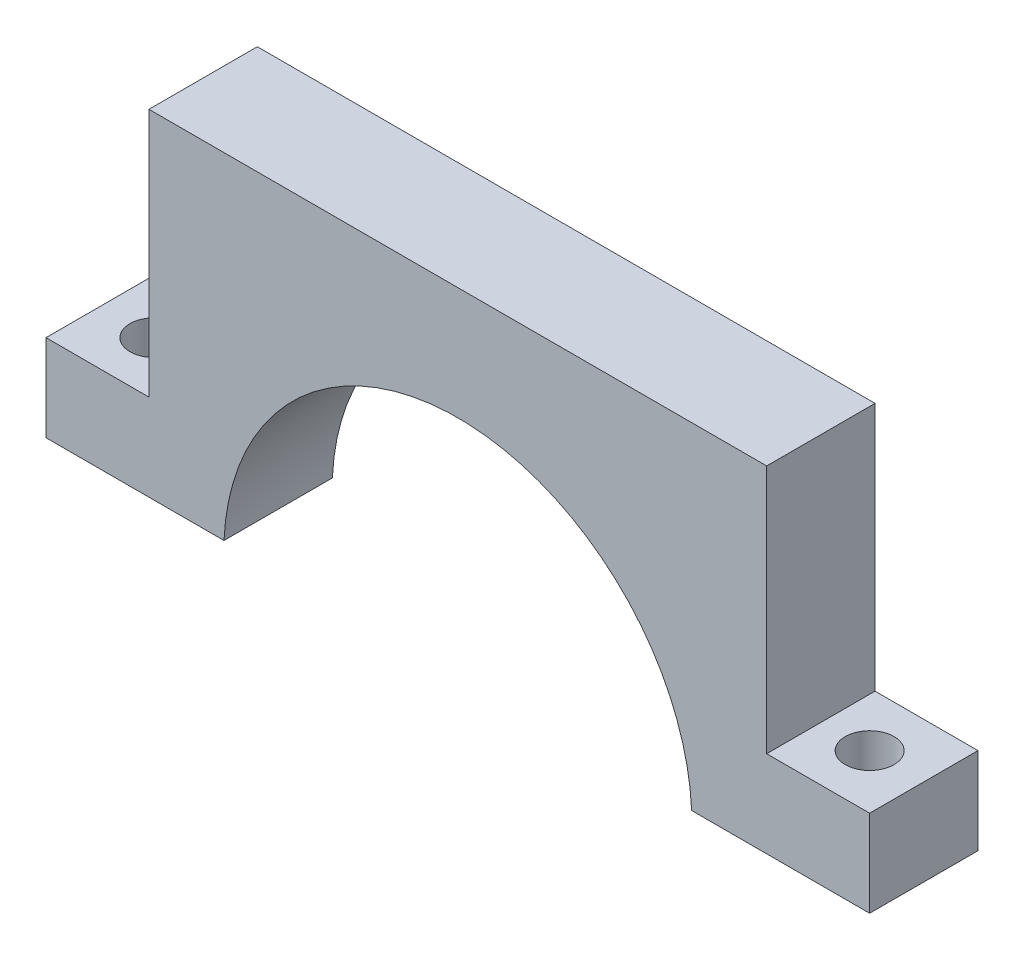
from build123d import *

# Parameters (mm, degrees)
EXTRUDE1_DEPTH     = 63.5
SKETCH2_R          = 14.2875
CUT_EXTRUDE1_DEPTH = 50.8


with BuildPart() as part:
    # Sketch1 → Extrude1 (new body)
    with BuildSketch(Plane.XY):
        with BuildLine():
            Line((-241.3, 6.35), (-137.012930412, 6.35))
            ThreePointArc((-137.012930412, 6.35), (0, 137.16), (137.012930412, 6.35))
            Line((137.012930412, 6.35), (241.3, 6.35))
            Line((241.3, 6.35), (241.3, 57.15))
            Line((241.3, 57.15), (180.975, 57.15))
            Line((180.975, 57.15), (180.975, 203.2))
            Line((180.975, 203.2), (-180.975, 203.2))
            Line((-180.975, 203.2), (-180.975, 57.15))
            Line((-180.975, 57.15), (-241.3, 57.15))
            Line((-241.3, 57.15), (-241.3, 6.35))
        make_face()
    extrude(amount=EXTRUDE1_DEPTH)

    # Sketch2 → Cut-Extrude1 (cut)
    with BuildSketch(Plane(origin=(0, 57.15, 0), x_dir=(-1, 0, 0), z_dir=(0, 1, 0))):
        with Locations(Location((209.55, 31.75, 0), (0, 0, 90))):
            Circle(SKETCH2_R)
        with Locations(Location((-209.55, 31.75, 0), (0, 0, 90))):
            Circle(SKETCH2_R)
    extrude(amount=-CUT_EXTRUDE1_DEPTH, mode=Mode.SUBTRACT)


solid = part.part
